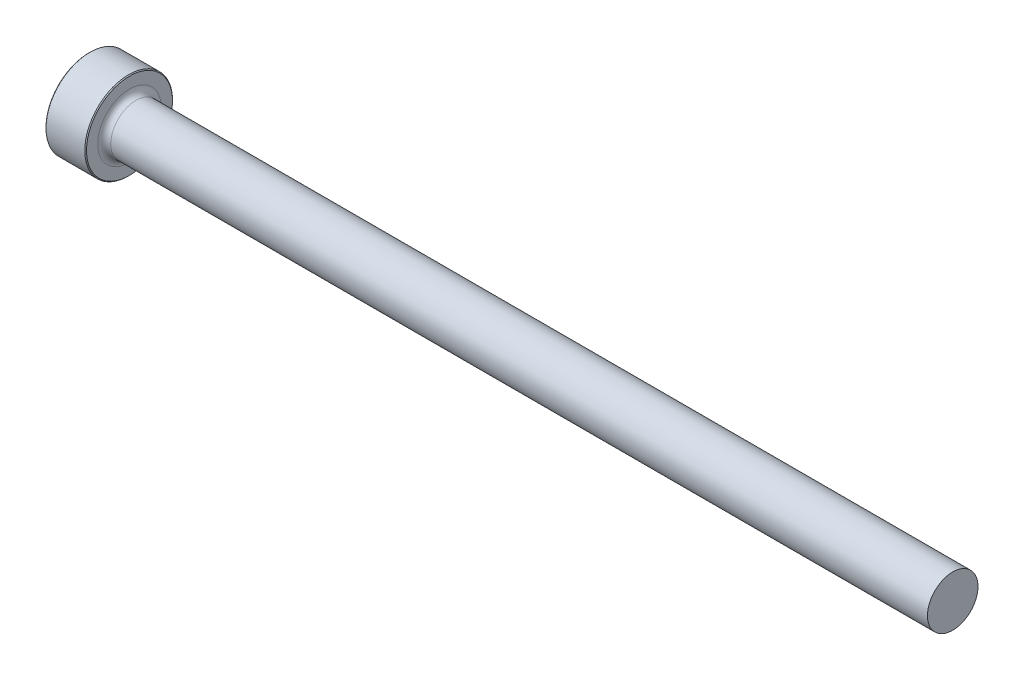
from build123d import *

# Parameters (mm, degrees)
CHAMFER1_SIZE = 0.1016


with BuildPart() as part:
    # Sketch1 → Revolve1 (revolve)
    with BuildSketch(Plane.XY):
        with BuildLine():
            Line((0, 0), (0, 5.159375))
            Line((0, 5.159375), (4.7625, 5.159375))
            Line((4.7625, 5.159375), (4.7625, 3.7347525))
            ThreePointArc((4.7625, 3.7347525), (4.985684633, 3.195937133), (5.5245, 2.9727525))
            Line((5.5245, 2.9727525), (101.6, 2.9727525))
            Line((101.6, 2.9727525), (101.6, 0))
            Line((101.6, 0), (0, 0))
        make_face()
    revolve(axis=Axis((101.6, 0, 0), (-1, 0, 0)))

    # Chamfer1
    chamfer1_edges = [part.edges().sort_by_distance(p)[0] for p in [
        (0, -5.159375, 0),
        (4.7625, -5.159375, 0),
    ]]
    chamfer(chamfer1_edges, length=CHAMFER1_SIZE)


solid = part.part
